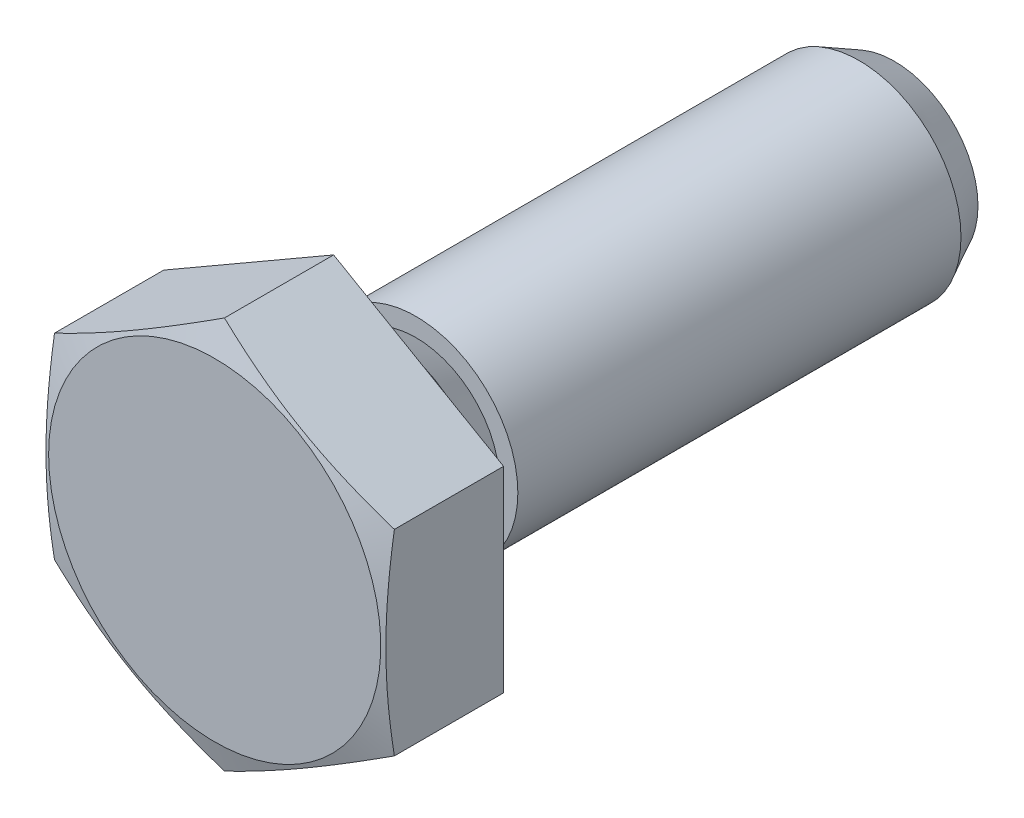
ISO-10303-21;
HEADER;
FILE_DESCRIPTION(('STEP AP214'),'2;1');
FILE_NAME('part.step','',(''),(''),'','','');
FILE_SCHEMA(('AUTOMOTIVE_DESIGN { 1 0 10303 214 1 1 1 1 }'));
ENDSEC;
DATA;
#1=APPLICATION_CONTEXT('core data for automotive mechanical design processes');
#2=APPLICATION_PROTOCOL_DEFINITION('international standard','automotive_design',2000,#1);
#3=PRODUCT_CONTEXT('',#1,'mechanical');
#4=PRODUCT('Part','Part','',(#3));
#5=PRODUCT_RELATED_PRODUCT_CATEGORY('part','',(#4));
#6=PRODUCT_DEFINITION_FORMATION('','',#4);
#7=PRODUCT_DEFINITION_CONTEXT('part definition',#1,'design');
#8=PRODUCT_DEFINITION('design','',#6,#7);
#9=PRODUCT_DEFINITION_SHAPE('','',#8);
#10=(LENGTH_UNIT() NAMED_UNIT(*) SI_UNIT(.MILLI.,.METRE.));
#11=(NAMED_UNIT(*) PLANE_ANGLE_UNIT() SI_UNIT($,.RADIAN.));
#12=(NAMED_UNIT(*) SI_UNIT($,.STERADIAN.) SOLID_ANGLE_UNIT());
#13=UNCERTAINTY_MEASURE_WITH_UNIT(LENGTH_MEASURE(1.E-05),#10,'distance_accuracy_value','');
#14=(GEOMETRIC_REPRESENTATION_CONTEXT(3) GLOBAL_UNCERTAINTY_ASSIGNED_CONTEXT((#13)) GLOBAL_UNIT_ASSIGNED_CONTEXT((#10,
#11,#12)) REPRESENTATION_CONTEXT('',''));
#15=CARTESIAN_POINT('',(0.,0.,0.));
#16=DIRECTION('',(0.,0.,1.));
#17=DIRECTION('',(1.,0.,0.));
#18=AXIS2_PLACEMENT_3D('',#15,#16,#17);
#19=CARTESIAN_POINT('',(0.,0.,0.5));
#20=DIRECTION('',(0.,0.,1.));
#21=DIRECTION('',(1.,0.,0.));
#22=AXIS2_PLACEMENT_3D('',#19,#20,#21);
#23=TOROIDAL_SURFACE('',#22,3.85,0.5);
#24=CARTESIAN_POINT('',(0.,0.,0.5));
#25=DIRECTION('',(0.,0.,1.));
#26=DIRECTION('',(1.,0.,0.));
#27=AXIS2_PLACEMENT_3D('',#24,#25,#26);
#28=CIRCLE('',#27,4.35);
#29=CARTESIAN_POINT('',(4.35000000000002,0.,0.500000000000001));
#30=VERTEX_POINT('',#29);
#31=EDGE_CURVE('E11',#30,#30,#28,.T.);
#32=ORIENTED_EDGE('',*,*,#31,.F.);
#33=EDGE_LOOP('',(#32));
#34=FACE_BOUND('',#33,.T.);
#35=CARTESIAN_POINT('',(0.,0.,0.));
#36=DIRECTION('',(0.,0.,1.));
#37=DIRECTION('',(1.,0.,0.));
#38=AXIS2_PLACEMENT_3D('',#35,#36,#37);
#39=CIRCLE('',#38,3.85);
#40=CARTESIAN_POINT('',(3.85000000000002,0.,0.));
#41=VERTEX_POINT('',#40);
#42=EDGE_CURVE('E24',#41,#41,#39,.T.);
#43=ORIENTED_EDGE('',*,*,#42,.T.);
#44=EDGE_LOOP('',(#43));
#45=FACE_BOUND('',#44,.T.);
#46=ADVANCED_FACE('F17',(#34,#45),#23,.T.);
#47=CARTESIAN_POINT('',(0.,3.85000000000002,0.));
#48=DIRECTION('',(0.,0.,-1.));
#49=DIRECTION('',(-1.,0.,0.));
#50=AXIS2_PLACEMENT_3D('',#47,#48,#49);
#51=PLANE('',#50);
#52=CARTESIAN_POINT('',(0.,0.,0.));
#53=DIRECTION('',(0.,0.,1.));
#54=DIRECTION('',(1.,0.,0.));
#55=AXIS2_PLACEMENT_3D('',#52,#53,#54);
#56=CIRCLE('',#55,3.3);
#57=CARTESIAN_POINT('',(3.30000000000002,0.,0.));
#58=VERTEX_POINT('',#57);
#59=EDGE_CURVE('E118',#58,#58,#56,.T.);
#60=ORIENTED_EDGE('',*,*,#59,.T.);
#61=EDGE_LOOP('',(#60));
#62=FACE_BOUND('',#61,.T.);
#63=ORIENTED_EDGE('',*,*,#42,.F.);
#64=EDGE_LOOP('',(#63));
#65=FACE_BOUND('',#64,.T.);
#66=ADVANCED_FACE('F124',(#62,#65),#51,.T.);
#67=CARTESIAN_POINT('',(0.,0.,-0.300000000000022));
#68=DIRECTION('',(0.,0.,1.));
#69=DIRECTION('',(1.,0.,0.));
#70=AXIS2_PLACEMENT_3D('',#67,#68,#69);
#71=TOROIDAL_SURFACE('',#70,3.3,0.3);
#72=CARTESIAN_POINT('',(0.,0.,-0.300000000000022));
#73=DIRECTION('',(0.,0.,1.));
#74=DIRECTION('',(1.,0.,0.));
#75=AXIS2_PLACEMENT_3D('',#72,#73,#74);
#76=CIRCLE('',#75,3.);
#77=CARTESIAN_POINT('',(3.00000000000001,0.,-0.300000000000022));
#78=VERTEX_POINT('',#77);
#79=EDGE_CURVE('E115',#78,#78,#76,.T.);
#80=ORIENTED_EDGE('',*,*,#79,.T.);
#81=EDGE_LOOP('',(#80));
#82=FACE_BOUND('',#81,.T.);
#83=ORIENTED_EDGE('',*,*,#59,.F.);
#84=EDGE_LOOP('',(#83));
#85=FACE_BOUND('',#84,.T.);
#86=ADVANCED_FACE('F126',(#82,#85),#71,.F.);
#87=CARTESIAN_POINT('',(0.,0.,0.5));
#88=DIRECTION('',(0.,0.,1.));
#89=DIRECTION('',(1.,0.,0.));
#90=AXIS2_PLACEMENT_3D('',#87,#88,#89);
#91=CYLINDRICAL_SURFACE('',#90,3.);
#92=CARTESIAN_POINT('',(0.,0.,-0.982527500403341));
#93=DIRECTION('',(0.,0.,1.));
#94=DIRECTION('',(1.,0.,0.));
#95=AXIS2_PLACEMENT_3D('',#92,#93,#94);
#96=CIRCLE('',#95,3.);
#97=CARTESIAN_POINT('',(3.00000000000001,0.,-0.98252750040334));
#98=VERTEX_POINT('',#97);
#99=EDGE_CURVE('E112',#98,#98,#96,.T.);
#100=ORIENTED_EDGE('',*,*,#99,.T.);
#101=EDGE_LOOP('',(#100));
#102=FACE_BOUND('',#101,.T.);
#103=ORIENTED_EDGE('',*,*,#79,.F.);
#104=EDGE_LOOP('',(#103));
#105=FACE_BOUND('',#104,.T.);
#106=ADVANCED_FACE('F133',(#102,#105),#91,.T.);
#107=CARTESIAN_POINT('',(0.,0.,-0.982527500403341));
#108=DIRECTION('',(0.,0.,1.));
#109=DIRECTION('',(1.,0.,0.));
#110=AXIS2_PLACEMENT_3D('',#107,#108,#109);
#111=CONICAL_SURFACE('',#110,3.,0.523598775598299);
#112=CARTESIAN_POINT('',(0.,0.,-1.91999999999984));
#113=DIRECTION('',(0.,0.,1.));
#114=DIRECTION('',(1.,0.,0.));
#115=AXIS2_PLACEMENT_3D('',#112,#113,#114);
#116=CIRCLE('',#115,2.45875);
#117=CARTESIAN_POINT('',(2.45875000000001,0.,-1.91999999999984));
#118=VERTEX_POINT('',#117);
#119=EDGE_CURVE('E109',#118,#118,#116,.T.);
#120=ORIENTED_EDGE('',*,*,#119,.T.);
#121=EDGE_LOOP('',(#120));
#122=FACE_BOUND('',#121,.T.);
#123=ORIENTED_EDGE('',*,*,#99,.F.);
#124=EDGE_LOOP('',(#123));
#125=FACE_BOUND('',#124,.T.);
#126=ADVANCED_FACE('F140',(#122,#125),#111,.T.);
#127=CARTESIAN_POINT('',(3.88578058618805E-13,2.45875000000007,-1.91999999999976));
#128=DIRECTION('',(0.,0.,1.));
#129=DIRECTION('',(1.,0.,0.));
#130=AXIS2_PLACEMENT_3D('',#127,#128,#129);
#131=PLANE('',#130);
#132=CARTESIAN_POINT('',(0.,0.,-1.91999999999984));
#133=DIRECTION('',(0.,0.,1.));
#134=DIRECTION('',(1.,0.,0.));
#135=AXIS2_PLACEMENT_3D('',#132,#133,#134);
#136=CIRCLE('',#135,3.);
#137=CARTESIAN_POINT('',(3.00000000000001,0.,-1.91999999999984));
#138=VERTEX_POINT('',#137);
#139=EDGE_CURVE('E106',#138,#138,#136,.T.);
#140=ORIENTED_EDGE('',*,*,#139,.T.);
#141=EDGE_LOOP('',(#140));
#142=FACE_BOUND('',#141,.T.);
#143=ORIENTED_EDGE('',*,*,#119,.F.);
#144=EDGE_LOOP('',(#143));
#145=FACE_BOUND('',#144,.T.);
#146=ADVANCED_FACE('F144',(#142,#145),#131,.T.);
#147=CARTESIAN_POINT('',(0.,0.,0.5));
#148=DIRECTION('',(0.,0.,1.));
#149=DIRECTION('',(1.,0.,0.));
#150=AXIS2_PLACEMENT_3D('',#147,#148,#149);
#151=CYLINDRICAL_SURFACE('',#150,3.);
#152=CARTESIAN_POINT('',(1.11022302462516E-13,0.,-14.9587499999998));
#153=DIRECTION('',(0.,0.,1.));
#154=DIRECTION('',(1.,0.,0.));
#155=AXIS2_PLACEMENT_3D('',#152,#153,#154);
#156=CIRCLE('',#155,3.);
#157=CARTESIAN_POINT('',(3.00000000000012,0.,-14.9587499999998));
#158=VERTEX_POINT('',#157);
#159=EDGE_CURVE('E103',#158,#158,#156,.T.);
#160=ORIENTED_EDGE('',*,*,#159,.T.);
#161=EDGE_LOOP('',(#160));
#162=FACE_BOUND('',#161,.T.);
#163=ORIENTED_EDGE('',*,*,#139,.F.);
#164=EDGE_LOOP('',(#163));
#165=FACE_BOUND('',#164,.T.);
#166=ADVANCED_FACE('F148',(#162,#165),#151,.T.);
#167=CARTESIAN_POINT('',(1.11022302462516E-13,0.,-14.9587499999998));
#168=DIRECTION('',(0.,0.,1.));
#169=DIRECTION('',(1.,0.,0.));
#170=AXIS2_PLACEMENT_3D('',#167,#168,#169);
#171=CONICAL_SURFACE('',#170,3.,0.479368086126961);
#172=CARTESIAN_POINT('',(0.,0.,-15.9999999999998));
#173=DIRECTION('',(0.,0.,1.));
#174=DIRECTION('',(1.,0.,0.));
#175=AXIS2_PLACEMENT_3D('',#172,#173,#174);
#176=CIRCLE('',#175,2.45875);
#177=CARTESIAN_POINT('',(2.45875000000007,0.,-15.9999999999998));
#178=VERTEX_POINT('',#177);
#179=EDGE_CURVE('E100',#178,#178,#176,.T.);
#180=ORIENTED_EDGE('',*,*,#179,.T.);
#181=EDGE_LOOP('',(#180));
#182=FACE_BOUND('',#181,.T.);
#183=ORIENTED_EDGE('',*,*,#159,.F.);
#184=EDGE_LOOP('',(#183));
#185=FACE_BOUND('',#184,.T.);
#186=ADVANCED_FACE('F152',(#182,#185),#171,.T.);
#187=CARTESIAN_POINT('',(3.88578058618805E-13,2.45875000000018,-15.9999999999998));
#188=DIRECTION('',(0.,0.,-1.));
#189=DIRECTION('',(-1.,0.,0.));
#190=AXIS2_PLACEMENT_3D('',#187,#188,#189);
#191=PLANE('',#190);
#192=ORIENTED_EDGE('',*,*,#179,.F.);
#193=EDGE_LOOP('',(#192));
#194=FACE_BOUND('',#193,.T.);
#195=ADVANCED_FACE('F156',(#194),#191,.T.);
#196=CARTESIAN_POINT('',(-5.,-2.88674999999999,0.5));
#197=DIRECTION('',(0.,0.,-1.));
#198=DIRECTION('',(-1.,0.,0.));
#199=AXIS2_PLACEMENT_3D('',#196,#197,#198);
#200=PLANE('',#199);
#201=DIRECTION('',(0.,-1.,0.));
#202=VECTOR('',#201,1.);
#203=CARTESIAN_POINT('',(-5.,2.88675000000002,0.5));
#204=LINE('',#203,#202);
#205=CARTESIAN_POINT('',(-5.,2.88675000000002,0.5));
#206=VERTEX_POINT('',#205);
#207=CARTESIAN_POINT('',(-5.,-2.88674999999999,0.5));
#208=VERTEX_POINT('',#207);
#209=EDGE_CURVE('E83',#206,#208,#204,.T.);
#210=ORIENTED_EDGE('',*,*,#209,.F.);
#211=DIRECTION('',(0.866025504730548,0.499999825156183,0.));
#212=VECTOR('',#211,1.);
#213=CARTESIAN_POINT('',(-5.,2.88675000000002,0.5));
#214=LINE('',#213,#212);
#215=CARTESIAN_POINT('',(3.33066907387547E-13,5.77350000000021,0.5));
#216=VERTEX_POINT('',#215);
#217=EDGE_CURVE('E88',#206,#216,#214,.T.);
#218=ORIENTED_EDGE('',*,*,#217,.T.);
#219=DIRECTION('',(0.866025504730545,-0.499999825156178,0.));
#220=VECTOR('',#219,1.);
#221=CARTESIAN_POINT('',(3.33066907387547E-13,5.77350000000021,0.5));
#222=LINE('',#221,#220);
#223=CARTESIAN_POINT('',(5.00000000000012,2.88675000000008,0.500000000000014));
#224=VERTEX_POINT('',#223);
#225=EDGE_CURVE('E94',#216,#224,#222,.T.);
#226=ORIENTED_EDGE('',*,*,#225,.T.);
#227=DIRECTION('',(0.,-1.,0.));
#228=VECTOR('',#227,1.);
#229=CARTESIAN_POINT('',(5.00000000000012,2.88675000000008,0.500000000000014));
#230=LINE('',#229,#228);
#231=CARTESIAN_POINT('',(5.00000000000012,-2.88674999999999,0.500000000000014));
#232=VERTEX_POINT('',#231);
#233=EDGE_CURVE('E246',#224,#232,#230,.T.);
#234=ORIENTED_EDGE('',*,*,#233,.T.);
#235=DIRECTION('',(-0.866025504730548,-0.499999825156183,0.));
#236=VECTOR('',#235,1.);
#237=CARTESIAN_POINT('',(5.00000000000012,-2.88674999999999,0.500000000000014));
#238=LINE('',#237,#236);
#239=CARTESIAN_POINT('',(1.66533453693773E-13,-5.77349999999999,0.5));
#240=VERTEX_POINT('',#239);
#241=EDGE_CURVE('E232',#232,#240,#238,.T.);
#242=ORIENTED_EDGE('',*,*,#241,.T.);
#243=DIRECTION('',(-0.866025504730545,0.499999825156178,0.));
#244=VECTOR('',#243,1.);
#245=CARTESIAN_POINT('',(1.66533453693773E-13,-5.77349999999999,0.5));
#246=LINE('',#245,#244);
#247=EDGE_CURVE('E230',#240,#208,#246,.T.);
#248=ORIENTED_EDGE('',*,*,#247,.T.);
#249=EDGE_LOOP('',(#210,#218,#226,#234,#242,#248));
#250=FACE_BOUND('',#249,.T.);
#251=ORIENTED_EDGE('',*,*,#31,.T.);
#252=EDGE_LOOP('',(#251));
#253=FACE_BOUND('',#252,.T.);
#254=ADVANCED_FACE('F160',(#250,#253),#200,.T.);
#255=CARTESIAN_POINT('',(-5.,2.88675000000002,0.5));
#256=DIRECTION('',(-1.,0.,0.));
#257=DIRECTION('',(0.,0.,1.));
#258=AXIS2_PLACEMENT_3D('',#255,#256,#257);
#259=PLANE('',#258);
#260=CARTESIAN_POINT('',(-5.00000000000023,3.41675832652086,3.62147932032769));
#261=CARTESIAN_POINT('',(-5.00000000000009,3.18521449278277,3.66374586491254));
#262=CARTESIAN_POINT('',(-5.00000000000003,2.95311617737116,3.70321492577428));
#263=CARTESIAN_POINT('',(-4.99999999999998,2.48772048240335,3.7752097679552));
#264=CARTESIAN_POINT('',(-5.,2.25442251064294,3.80773169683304));
#265=CARTESIAN_POINT('',(-5.00000000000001,1.78700251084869,3.86440884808));
#266=CARTESIAN_POINT('',(-5.,1.55288140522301,3.88857151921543));
#267=CARTESIAN_POINT('',(-5.,1.08387721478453,3.92726925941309));
#268=CARTESIAN_POINT('',(-5.,0.84899428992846,3.94180623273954));
#269=CARTESIAN_POINT('',(-5.,0.382139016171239,3.96021768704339));
#270=CARTESIAN_POINT('',(-5.,0.150172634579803,3.96424046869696));
#271=CARTESIAN_POINT('',(-4.99999999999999,-0.313714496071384,3.96178586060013));
#272=CARTESIAN_POINT('',(-4.99999999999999,-0.545635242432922,3.95530797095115));
#273=CARTESIAN_POINT('',(-5.,-1.00889633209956,3.93227848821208));
#274=CARTESIAN_POINT('',(-5.00000000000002,-1.24023682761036,3.91572989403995));
#275=CARTESIAN_POINT('',(-4.99999999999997,-1.70207710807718,3.87354149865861));
#276=CARTESIAN_POINT('',(-4.99999999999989,-1.93257687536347,3.84790150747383));
#277=CARTESIAN_POINT('',(-4.99999999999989,-2.39244352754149,3.78882004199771));
#278=CARTESIAN_POINT('',(-4.99999999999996,-2.62181091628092,3.75538243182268));
#279=CARTESIAN_POINT('',(-5.00000000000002,-3.07949423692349,3.68201701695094));
#280=CARTESIAN_POINT('',(-5.,-3.30781016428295,3.64208918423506));
#281=CARTESIAN_POINT('',(-4.99999999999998,-3.76361168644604,3.55691732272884));
#282=CARTESIAN_POINT('',(-4.99999999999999,-3.99109655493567,3.51166944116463));
#283=CARTESIAN_POINT('',(-4.99999999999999,-4.44517705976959,3.41690513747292));
#284=CARTESIAN_POINT('',(-4.99999999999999,-4.67177266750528,3.36738857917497));
#285=CARTESIAN_POINT('',(-4.99999999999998,-5.12792425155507,3.26407751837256));
#286=CARTESIAN_POINT('',(-4.99999999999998,-5.35746720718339,3.21022580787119));
#287=CARTESIAN_POINT('',(-4.99999999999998,-5.81586669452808,3.09967387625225));
#288=CARTESIAN_POINT('',(-4.99999999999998,-6.04472321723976,3.04297361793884));
#289=CARTESIAN_POINT('',(-4.99999999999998,-6.50137473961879,2.92739984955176));
#290=CARTESIAN_POINT('',(-4.99999999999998,-6.72917095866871,2.86853114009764));
#291=CARTESIAN_POINT('',(-4.99999999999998,-7.18425622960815,2.748920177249));
#292=CARTESIAN_POINT('',(-4.99999999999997,-7.41154531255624,2.68817804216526));
#293=CARTESIAN_POINT('',(-4.99999999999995,-7.63863176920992,2.62670107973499));
#294=B_SPLINE_CURVE_WITH_KNOTS('',3,(#260,#261,#262,#263,#264,#265,#266,#267,#268,#269,#270,
#271,#272,#273,#274,#275,#276,#277,#278,#279,#280,#281,#282,#283,#284,#285,#286,#287,#288,#289,
#290,#291,#292,#293),.UNSPECIFIED.,.F.,.F.,(4,2,2,2,2,2,2,2,2,2,2,2,2,2,2,2,4),(0.,
0.70615757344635,1.4127057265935,2.11862265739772,2.82439989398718,3.52016717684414,
4.21596758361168,4.91156089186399,5.60716873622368,6.3024326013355,6.99769946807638,
7.69347298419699,8.38926870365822,9.09657212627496,9.803884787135,10.5097159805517,
11.2155026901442),.UNSPECIFIED.);
#295=CARTESIAN_POINT('',(-5.,2.88675000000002,3.71288574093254));
#296=VERTEX_POINT('',#295);
#297=CARTESIAN_POINT('',(-5.,-2.88674999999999,3.71288574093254));
#298=VERTEX_POINT('',#297);
#299=EDGE_CURVE('E72',#296,#298,#294,.T.);
#300=ORIENTED_EDGE('',*,*,#299,.F.);
#301=DIRECTION('',(0.,0.,1.));
#302=VECTOR('',#301,1.);
#303=CARTESIAN_POINT('',(-5.,2.88675000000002,0.5));
#304=LINE('',#303,#302);
#305=EDGE_CURVE('E81',#206,#296,#304,.T.);
#306=ORIENTED_EDGE('',*,*,#305,.F.);
#307=ORIENTED_EDGE('',*,*,#209,.T.);
#308=DIRECTION('',(0.,0.,1.));
#309=VECTOR('',#308,1.);
#310=CARTESIAN_POINT('',(-5.,-2.88674999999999,0.5));
#311=LINE('',#310,#309);
#312=EDGE_CURVE('E39',#208,#298,#311,.T.);
#313=ORIENTED_EDGE('',*,*,#312,.T.);
#314=EDGE_LOOP('',(#300,#306,#307,#313));
#315=FACE_BOUND('',#314,.T.);
#316=ADVANCED_FACE('F79',(#315),#259,.T.);
#317=CARTESIAN_POINT('',(1.66533453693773E-13,-5.77349999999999,0.5));
#318=DIRECTION('',(0.499999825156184,0.866025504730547,0.));
#319=DIRECTION('',(0.866025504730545,-0.499999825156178,0.));
#320=AXIS2_PLACEMENT_3D('',#317,#318,#319);
#321=PLANE('',#320);
#322=DIRECTION('',(0.,0.,1.));
#323=VECTOR('',#322,1.);
#324=CARTESIAN_POINT('',(1.66533453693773E-13,-5.77349999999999,0.5));
#325=LINE('',#324,#323);
#326=CARTESIAN_POINT('',(1.11022302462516E-13,-5.77349999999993,3.71288639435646));
#327=VERTEX_POINT('',#326);
#328=EDGE_CURVE('E237',#240,#327,#325,.T.);
#329=ORIENTED_EDGE('',*,*,#328,.T.);
#330=CARTESIAN_POINT('',(2.00000127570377E-07,-5.77350011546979,3.71288635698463));
#331=CARTESIAN_POINT('',(-0.207322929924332,-5.65380210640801,3.75164026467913));
#332=CARTESIAN_POINT('',(-0.415190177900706,-5.5337899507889,3.78686112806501));
#333=CARTESIAN_POINT('',(-0.831994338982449,-5.29314806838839,3.84878739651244));
#334=CARTESIAN_POINT('',(-1.04093182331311,-5.17251801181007,3.87548763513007));
#335=CARTESIAN_POINT('',(-1.45803647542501,-4.93170264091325,3.91871011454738));
#336=CARTESIAN_POINT('',(-1.66619766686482,-4.81152077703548,3.9353071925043));
#337=CARTESIAN_POINT('',(-2.08290600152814,-4.57093422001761,3.95756562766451));
#338=CARTESIAN_POINT('',(-2.29145301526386,-4.4505296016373,3.96323015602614));
#339=CARTESIAN_POINT('',(-2.70854704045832,-4.20972036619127,3.9632300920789));
#340=CARTESIAN_POINT('',(-2.91709405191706,-4.08931574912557,3.9575654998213));
#341=CARTESIAN_POINT('',(-3.33380237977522,-3.84872919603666,3.93530694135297));
#342=CARTESIAN_POINT('',(-3.54196356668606,-3.72854733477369,3.91870980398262));
#343=CARTESIAN_POINT('',(-3.95906820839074,-3.48773196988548,3.87548721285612));
#344=CARTESIAN_POINT('',(-4.16800568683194,-3.36710191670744,3.84878692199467));
#345=CARTESIAN_POINT('',(-4.58480983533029,-3.12646004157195,3.78686055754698));
#346=CARTESIAN_POINT('',(-4.79267707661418,-3.00644788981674,3.75163965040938));
#347=CARTESIAN_POINT('',(-5.00000019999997,-2.88674988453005,3.71288570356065));
#348=B_SPLINE_CURVE_WITH_KNOTS('',3,(#330,#331,#332,#333,#334,#335,#336,#337,#338,#339,#340,
#341,#342,#343,#344,#345,#346,#347),.UNSPECIFIED.,.F.,.F.,(4,2,2,2,2,2,2,2,4),(0.,
0.727595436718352,1.45563121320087,2.17820641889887,2.90057199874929,3.62293757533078,
4.34551277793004,5.07354855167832,5.80114398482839),.UNSPECIFIED.);
#349=EDGE_CURVE('E84',#327,#298,#348,.T.);
#350=ORIENTED_EDGE('',*,*,#349,.T.);
#351=ORIENTED_EDGE('',*,*,#312,.F.);
#352=ORIENTED_EDGE('',*,*,#247,.F.);
#353=EDGE_LOOP('',(#329,#350,#351,#352));
#354=FACE_BOUND('',#353,.T.);
#355=ADVANCED_FACE('F165',(#354),#321,.F.);
#356=CARTESIAN_POINT('',(5.00000000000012,-2.88674999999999,0.500000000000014));
#357=DIRECTION('',(-0.499999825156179,0.866025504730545,0.));
#358=DIRECTION('',(0.866025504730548,0.499999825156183,0.));
#359=AXIS2_PLACEMENT_3D('',#356,#357,#358);
#360=PLANE('',#359);
#361=DIRECTION('',(0.,0.,1.));
#362=VECTOR('',#361,1.);
#363=CARTESIAN_POINT('',(5.00000000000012,-2.88674999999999,0.500000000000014));
#364=LINE('',#363,#362);
#365=CARTESIAN_POINT('',(5.00000000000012,-2.88674999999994,3.71288574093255));
#366=VERTEX_POINT('',#365);
#367=EDGE_CURVE('E240',#232,#366,#364,.T.);
#368=ORIENTED_EDGE('',*,*,#367,.T.);
#369=CARTESIAN_POINT('',(5.00000020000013,-2.88674988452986,3.71288570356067));
#370=CARTESIAN_POINT('',(4.79267707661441,-3.00644788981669,3.75163965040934));
#371=CARTESIAN_POINT('',(4.58480983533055,-3.12646004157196,3.78686055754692));
#372=CARTESIAN_POINT('',(4.16800568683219,-3.3671019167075,3.84878692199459));
#373=CARTESIAN_POINT('',(3.95906820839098,-3.48773196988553,3.87548721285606));
#374=CARTESIAN_POINT('',(3.54196356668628,-3.72854733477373,3.91870980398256));
#375=CARTESIAN_POINT('',(3.33380237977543,-3.84872919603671,3.93530694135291));
#376=CARTESIAN_POINT('',(2.91709405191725,-4.08931574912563,3.95756549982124));
#377=CARTESIAN_POINT('',(2.7085470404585,-4.20972036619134,3.96323009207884));
#378=CARTESIAN_POINT('',(2.29145301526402,-4.45052960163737,3.96323015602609));
#379=CARTESIAN_POINT('',(2.0829060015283,-4.57093422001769,3.95756562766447));
#380=CARTESIAN_POINT('',(1.66619766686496,-4.81152077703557,3.93530719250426));
#381=CARTESIAN_POINT('',(1.45803647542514,-4.93170264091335,3.91871011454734));
#382=CARTESIAN_POINT('',(1.04093182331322,-5.17251801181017,3.87548763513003));
#383=CARTESIAN_POINT('',(0.831994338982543,-5.29314806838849,3.8487873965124));
#384=CARTESIAN_POINT('',(0.415190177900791,-5.53378995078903,3.78686112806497));
#385=CARTESIAN_POINT('',(0.20732292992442,-5.65380210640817,3.75164026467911));
#386=CARTESIAN_POINT('',(-2.00000016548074E-07,-5.77350011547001,3.71288635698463));
#387=B_SPLINE_CURVE_WITH_KNOTS('',3,(#369,#370,#371,#372,#373,#374,#375,#376,#377,#378,#379,
#380,#381,#382,#383,#384,#385,#386),.UNSPECIFIED.,.F.,.F.,(4,2,2,2,2,2,2,2,4),(0.,
0.727595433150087,1.4556312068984,2.17820640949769,2.90057198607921,3.62293756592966,
4.34551277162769,5.07354854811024,5.80114398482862),.UNSPECIFIED.);
#388=EDGE_CURVE('E203',#366,#327,#387,.T.);
#389=ORIENTED_EDGE('',*,*,#388,.T.);
#390=ORIENTED_EDGE('',*,*,#328,.F.);
#391=ORIENTED_EDGE('',*,*,#241,.F.);
#392=EDGE_LOOP('',(#368,#389,#390,#391));
#393=FACE_BOUND('',#392,.T.);
#394=ADVANCED_FACE('F208',(#393),#360,.F.);
#395=CARTESIAN_POINT('',(5.00000000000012,2.88675000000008,0.500000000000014));
#396=DIRECTION('',(-1.,0.,0.));
#397=DIRECTION('',(0.,0.,1.));
#398=AXIS2_PLACEMENT_3D('',#395,#396,#397);
#399=PLANE('',#398);
#400=DIRECTION('',(0.,0.,1.));
#401=VECTOR('',#400,1.);
#402=CARTESIAN_POINT('',(5.00000000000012,2.88675000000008,0.500000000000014));
#403=LINE('',#402,#401);
#404=CARTESIAN_POINT('',(5.,2.88675000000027,3.71288574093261));
#405=VERTEX_POINT('',#404);
#406=EDGE_CURVE('E92',#224,#405,#403,.T.);
#407=ORIENTED_EDGE('',*,*,#406,.T.);
#408=CARTESIAN_POINT('',(5.00000000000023,3.41675832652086,3.62147932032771));
#409=CARTESIAN_POINT('',(5.00000000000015,3.18521449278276,3.66374586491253));
#410=CARTESIAN_POINT('',(5.00000000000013,2.95311617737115,3.70321492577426));
#411=CARTESIAN_POINT('',(5.0000000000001,2.48772048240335,3.77520976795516));
#412=CARTESIAN_POINT('',(5.00000000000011,2.25442251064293,3.80773169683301));
#413=CARTESIAN_POINT('',(5.00000000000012,1.78700251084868,3.86440884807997));
#414=CARTESIAN_POINT('',(5.00000000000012,1.552881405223,3.8885715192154));
#415=CARTESIAN_POINT('',(5.00000000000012,1.08387721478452,3.92726925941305));
#416=CARTESIAN_POINT('',(5.00000000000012,0.848994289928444,3.9418062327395));
#417=CARTESIAN_POINT('',(5.00000000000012,0.382139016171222,3.96021768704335));
#418=CARTESIAN_POINT('',(5.00000000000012,0.150172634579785,3.96424046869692));
#419=CARTESIAN_POINT('',(5.00000000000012,-0.313714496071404,3.96178586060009));
#420=CARTESIAN_POINT('',(5.00000000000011,-0.545635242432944,3.95530797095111));
#421=CARTESIAN_POINT('',(5.00000000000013,-1.00889633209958,3.93227848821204));
#422=CARTESIAN_POINT('',(5.00000000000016,-1.24023682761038,3.91572989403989));
#423=CARTESIAN_POINT('',(5.00000000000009,-1.7020771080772,3.87354149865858));
#424=CARTESIAN_POINT('',(5.,-1.9325768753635,3.84790150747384));
#425=CARTESIAN_POINT('',(5.00000000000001,-2.39244352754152,3.78882004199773));
#426=CARTESIAN_POINT('',(5.0000000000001,-2.62181091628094,3.75538243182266));
#427=CARTESIAN_POINT('',(5.00000000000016,-3.0794942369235,3.68201701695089));
#428=CARTESIAN_POINT('',(5.00000000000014,-3.30781016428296,3.64208918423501));
#429=CARTESIAN_POINT('',(5.00000000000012,-3.76361168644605,3.55691732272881));
#430=CARTESIAN_POINT('',(5.00000000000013,-3.99109655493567,3.5116694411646));
#431=CARTESIAN_POINT('',(5.00000000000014,-4.44517705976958,3.41690513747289));
#432=CARTESIAN_POINT('',(5.00000000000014,-4.67177266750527,3.36738857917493));
#433=CARTESIAN_POINT('',(5.00000000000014,-5.12792425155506,3.26407751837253));
#434=CARTESIAN_POINT('',(5.00000000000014,-5.35746720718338,3.21022580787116));
#435=CARTESIAN_POINT('',(5.00000000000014,-5.81586669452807,3.09967387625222));
#436=CARTESIAN_POINT('',(5.00000000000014,-6.04472321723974,3.04297361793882));
#437=CARTESIAN_POINT('',(5.00000000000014,-6.50137473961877,2.92739984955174));
#438=CARTESIAN_POINT('',(5.00000000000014,-6.72917095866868,2.86853114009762));
#439=CARTESIAN_POINT('',(5.00000000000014,-7.18425622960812,2.74892017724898));
#440=CARTESIAN_POINT('',(5.00000000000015,-7.41154531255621,2.68817804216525));
#441=CARTESIAN_POINT('',(5.00000000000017,-7.6386317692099,2.626701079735));
#442=B_SPLINE_CURVE_WITH_KNOTS('',3,(#408,#409,#410,#411,#412,#413,#414,#415,#416,#417,#418,
#419,#420,#421,#422,#423,#424,#425,#426,#427,#428,#429,#430,#431,#432,#433,#434,#435,#436,#437,
#438,#439,#440,#441),.UNSPECIFIED.,.F.,.F.,(4,2,2,2,2,2,2,2,2,2,2,2,2,2,2,2,4),(0.,
0.706157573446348,1.4127057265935,2.11862265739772,2.82439989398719,3.52016717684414,
4.21596758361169,4.911560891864,5.60716873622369,6.3024326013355,6.99769946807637,
7.69347298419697,8.3892687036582,9.09657212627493,9.80388478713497,10.5097159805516,
11.2155026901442),.UNSPECIFIED.);
#443=EDGE_CURVE('E198',#405,#366,#442,.T.);
#444=ORIENTED_EDGE('',*,*,#443,.T.);
#445=ORIENTED_EDGE('',*,*,#367,.F.);
#446=ORIENTED_EDGE('',*,*,#233,.F.);
#447=EDGE_LOOP('',(#407,#444,#445,#446));
#448=FACE_BOUND('',#447,.T.);
#449=ADVANCED_FACE('F211',(#448),#399,.F.);
#450=CARTESIAN_POINT('',(3.33066907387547E-13,5.77350000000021,0.5));
#451=DIRECTION('',(-0.499999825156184,-0.866025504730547,0.));
#452=DIRECTION('',(-0.866025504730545,0.499999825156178,0.));
#453=AXIS2_PLACEMENT_3D('',#450,#451,#452);
#454=PLANE('',#453);
#455=DIRECTION('',(0.,0.,1.));
#456=VECTOR('',#455,1.);
#457=CARTESIAN_POINT('',(3.33066907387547E-13,5.77350000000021,0.5));
#458=LINE('',#457,#456);
#459=CARTESIAN_POINT('',(2.77555756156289E-13,5.77350000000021,3.71288639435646));
#460=VERTEX_POINT('',#459);
#461=EDGE_CURVE('E90',#216,#460,#458,.T.);
#462=ORIENTED_EDGE('',*,*,#461,.T.);
#463=CARTESIAN_POINT('',(-1.99999850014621E-07,5.77350011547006,3.71288635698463));
#464=CARTESIAN_POINT('',(0.207322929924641,5.65380210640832,3.75164026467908));
#465=CARTESIAN_POINT('',(0.415190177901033,5.53378995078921,3.78686112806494));
#466=CARTESIAN_POINT('',(0.831994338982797,5.2931480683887,3.84878739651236));
#467=CARTESIAN_POINT('',(1.04093182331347,5.17251801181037,3.87548763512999));
#468=CARTESIAN_POINT('',(1.45803647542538,4.93170264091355,3.91871011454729));
#469=CARTESIAN_POINT('',(1.66619766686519,4.81152077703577,3.93530719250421));
#470=CARTESIAN_POINT('',(2.08290600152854,4.5709342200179,3.95756562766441));
#471=CARTESIAN_POINT('',(2.29145301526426,4.45052960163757,3.96323015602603));
#472=CARTESIAN_POINT('',(2.70854704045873,4.20972036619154,3.96323009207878));
#473=CARTESIAN_POINT('',(2.91709405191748,4.08931574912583,3.95756549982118));
#474=CARTESIAN_POINT('',(3.33380237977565,3.84872919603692,3.93530694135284));
#475=CARTESIAN_POINT('',(3.5419635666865,3.72854733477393,3.91870980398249));
#476=CARTESIAN_POINT('',(3.95906820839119,3.48773196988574,3.87548721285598));
#477=CARTESIAN_POINT('',(4.16800568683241,3.36710191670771,3.84878692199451));
#478=CARTESIAN_POINT('',(4.58480983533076,3.12646004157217,3.78686055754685));
#479=CARTESIAN_POINT('',(4.79267707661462,3.0064478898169,3.75163965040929));
#480=CARTESIAN_POINT('',(5.00000020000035,2.88674988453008,3.71288570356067));
#481=B_SPLINE_CURVE_WITH_KNOTS('',3,(#463,#464,#465,#466,#467,#468,#469,#470,#471,#472,#473,
#474,#475,#476,#477,#478,#479,#480),.UNSPECIFIED.,.F.,.F.,(4,2,2,2,2,2,2,2,4),(0.,
0.727595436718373,1.45563121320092,2.17820641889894,2.90057199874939,3.6229375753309,
4.34551277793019,5.07354855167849,5.80114398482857),.UNSPECIFIED.);
#482=EDGE_CURVE('E31',#460,#405,#481,.T.);
#483=ORIENTED_EDGE('',*,*,#482,.T.);
#484=ORIENTED_EDGE('',*,*,#406,.F.);
#485=ORIENTED_EDGE('',*,*,#225,.F.);
#486=EDGE_LOOP('',(#462,#483,#484,#485));
#487=FACE_BOUND('',#486,.T.);
#488=ADVANCED_FACE('F215',(#487),#454,.F.);
#489=CARTESIAN_POINT('',(-5.,2.88675000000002,0.5));
#490=DIRECTION('',(0.499999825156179,-0.866025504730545,0.));
#491=DIRECTION('',(-0.866025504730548,-0.499999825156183,0.));
#492=AXIS2_PLACEMENT_3D('',#489,#490,#491);
#493=PLANE('',#492);
#494=ORIENTED_EDGE('',*,*,#305,.T.);
#495=CARTESIAN_POINT('',(-5.00000019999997,2.88674988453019,3.71288570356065));
#496=CARTESIAN_POINT('',(-4.79267707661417,3.00644788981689,3.75163965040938));
#497=CARTESIAN_POINT('',(-4.58480983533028,3.1264600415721,3.78686055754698));
#498=CARTESIAN_POINT('',(-4.1680056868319,3.36710191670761,3.84878692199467));
#499=CARTESIAN_POINT('',(-3.95906820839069,3.48773196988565,3.87548721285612));
#500=CARTESIAN_POINT('',(-3.541963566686,3.72854733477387,3.91870980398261));
#501=CARTESIAN_POINT('',(-3.33380237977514,3.84872919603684,3.93530694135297));
#502=CARTESIAN_POINT('',(-2.91709405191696,4.08931574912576,3.95756549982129));
#503=CARTESIAN_POINT('',(-2.70854704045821,4.20972036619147,3.96323009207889));
#504=CARTESIAN_POINT('',(-2.29145301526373,4.45052960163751,3.96323015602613));
#505=CARTESIAN_POINT('',(-2.082906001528,4.57093422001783,3.9575656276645));
#506=CARTESIAN_POINT('',(-1.66619766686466,4.81152077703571,3.93530719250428));
#507=CARTESIAN_POINT('',(-1.45803647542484,4.93170264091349,3.91871011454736));
#508=CARTESIAN_POINT('',(-1.04093182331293,5.1725180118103,3.87548763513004));
#509=CARTESIAN_POINT('',(-0.831994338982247,5.29314806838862,3.84878739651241));
#510=CARTESIAN_POINT('',(-0.415190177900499,5.53378995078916,3.78686112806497));
#511=CARTESIAN_POINT('',(-0.207322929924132,5.65380210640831,3.75164026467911));
#512=CARTESIAN_POINT('',(2.0000029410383E-07,5.77350011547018,3.71288635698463));
#513=B_SPLINE_CURVE_WITH_KNOTS('',3,(#495,#496,#497,#498,#499,#500,#501,#502,#503,#504,#505,
#506,#507,#508,#509,#510,#511,#512),.UNSPECIFIED.,.F.,.F.,(4,2,2,2,2,2,2,2,4),(0.,
0.727595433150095,1.45563120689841,2.17820640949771,2.90057198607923,3.62293756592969,
4.34551277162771,5.07354854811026,5.80114398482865),.UNSPECIFIED.);
#514=EDGE_CURVE('E68',#296,#460,#513,.T.);
#515=ORIENTED_EDGE('',*,*,#514,.T.);
#516=ORIENTED_EDGE('',*,*,#461,.F.);
#517=ORIENTED_EDGE('',*,*,#217,.F.);
#518=EDGE_LOOP('',(#494,#515,#516,#517));
#519=FACE_BOUND('',#518,.T.);
#520=ADVANCED_FACE('F86',(#519),#493,.F.);
#521=CARTESIAN_POINT('',(0.,0.,3.67551454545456));
#522=DIRECTION('',(0.,0.,-1.));
#523=DIRECTION('',(-1.,0.,0.));
#524=AXIS2_PLACEMENT_3D('',#521,#522,#523);
#525=CONICAL_SURFACE('',#524,5.88897,1.25778607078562);
#526=ORIENTED_EDGE('',*,*,#299,.T.);
#527=ORIENTED_EDGE('',*,*,#349,.F.);
#528=ORIENTED_EDGE('',*,*,#388,.F.);
#529=ORIENTED_EDGE('',*,*,#443,.F.);
#530=ORIENTED_EDGE('',*,*,#482,.F.);
#531=ORIENTED_EDGE('',*,*,#514,.F.);
#532=EDGE_LOOP('',(#526,#527,#528,#529,#530,#531));
#533=FACE_BOUND('',#532,.T.);
#534=CARTESIAN_POINT('',(0.,0.,4.));
#535=DIRECTION('',(0.,0.,-1.));
#536=DIRECTION('',(-1.,0.,0.));
#537=AXIS2_PLACEMENT_3D('',#534,#535,#536);
#538=CIRCLE('',#537,4.88638820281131);
#539=CARTESIAN_POINT('',(-4.88638820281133,0.,4.));
#540=VERTEX_POINT('',#539);
#541=EDGE_CURVE('E76',#540,#540,#538,.F.);
#542=ORIENTED_EDGE('',*,*,#541,.F.);
#543=EDGE_LOOP('',(#542));
#544=FACE_BOUND('',#543,.T.);
#545=ADVANCED_FACE('F70',(#533,#544),#525,.T.);
#546=CARTESIAN_POINT('',(-5.,-2.88674999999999,4.));
#547=DIRECTION('',(0.,0.,-1.));
#548=DIRECTION('',(-1.,0.,0.));
#549=AXIS2_PLACEMENT_3D('',#546,#547,#548);
#550=PLANE('',#549);
#551=ORIENTED_EDGE('',*,*,#541,.T.);
#552=EDGE_LOOP('',(#551));
#553=FACE_BOUND('',#552,.T.);
#554=ADVANCED_FACE('F181',(#553),#550,.F.);
#555=CLOSED_SHELL('',(#46,#66,#86,#106,#126,#146,#166,#186,#195,#254,#316,#355,#394,#449,#488,
#520,#545,#554));
#556=MANIFOLD_SOLID_BREP('B1',#555);
#557=ADVANCED_BREP_SHAPE_REPRESENTATION('',(#18,#556),#14);
#558=SHAPE_DEFINITION_REPRESENTATION(#9,#557);
ENDSEC;
END-ISO-10303-21;
